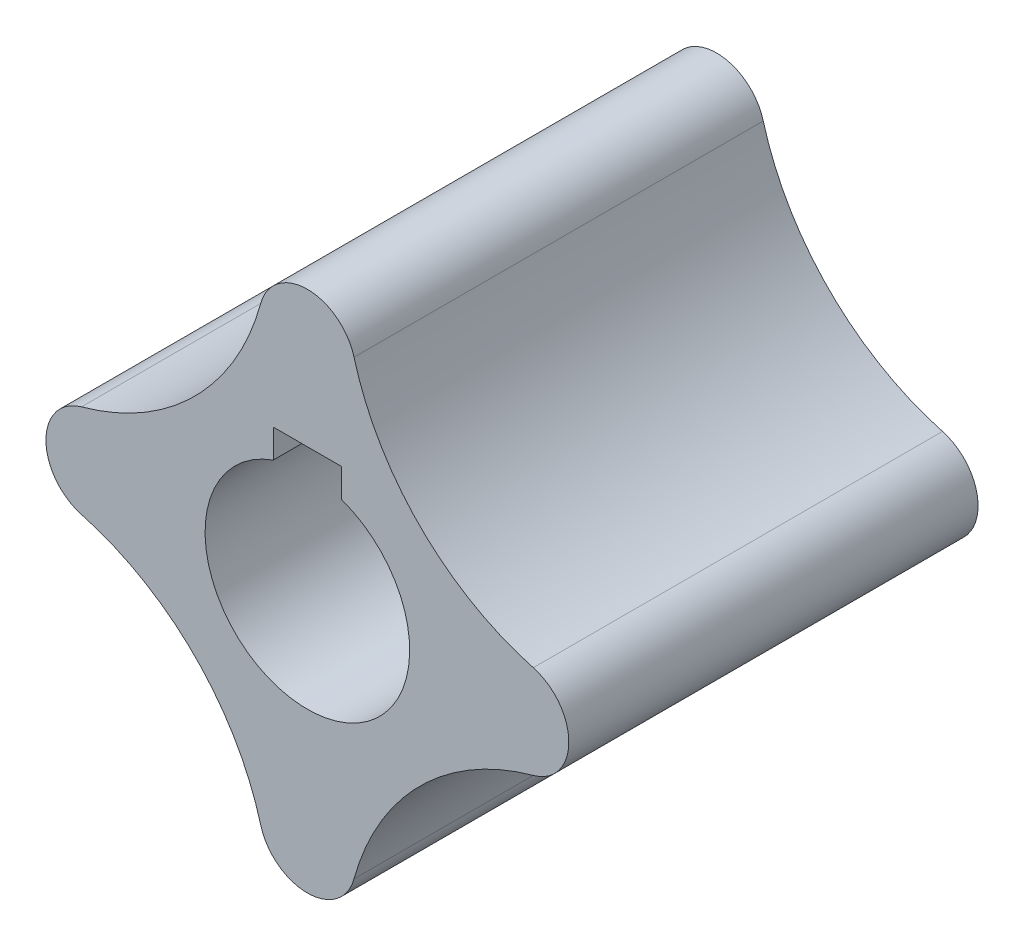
from build123d import *

# Parameters (mm, degrees)
EXTRUDE_1_DEPTH = 36


with BuildPart() as part:
    # Sketch 1 → Extrude 1 (new body)
    with BuildSketch(Plane.XY):
        with BuildLine():
            ThreePointArc((8.603088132, 19.870851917), (4.5, 23), (0.396911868, 19.870851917))
            ThreePointArc((0.396911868, 19.870851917), (-5.399494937, 9.899494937), (-15.370851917, 4.103088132))
            ThreePointArc((-15.370851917, 4.103088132), (-18.5, 0), (-15.370851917, -4.103088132))
            ThreePointArc((-15.370851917, -4.103088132), (-5.399494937, -9.899494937), (0.396911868, -19.870851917))
            ThreePointArc((0.396911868, -19.870851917), (4.5, -23), (8.603088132, -19.870851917))
            ThreePointArc((8.603088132, -19.870851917), (14.399494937, -9.899494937), (24.370851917, -4.103088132))
            ThreePointArc((24.370851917, -4.103088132), (27.5, 0), (24.370851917, 4.103088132))
            ThreePointArc((24.370851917, 4.103088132), (14.399494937, 9.899494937), (8.603088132, 19.870851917))
        make_face()
        with BuildLine():
            Line((1.5, 8.485281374), (1.5, 11))
            Line((1.5, 11), (7.5, 11))
            Line((7.5, 11), (7.5, 8.485281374))
            ThreePointArc((7.5, 8.485281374), (4.5, -9), (1.5, 8.485281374))
        make_face(mode=Mode.SUBTRACT)
    extrude(amount=EXTRUDE_1_DEPTH)


solid = part.part
